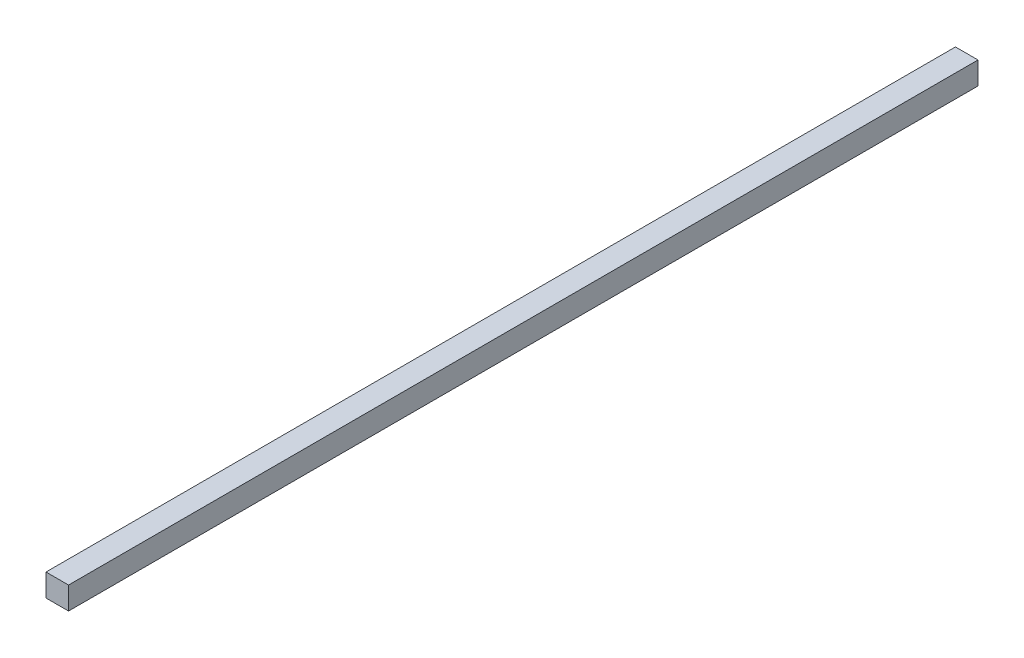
ISO-10303-21;
HEADER;
FILE_DESCRIPTION(('STEP AP214'),'2;1');
FILE_NAME('part.step','',(''),(''),'','','');
FILE_SCHEMA(('AUTOMOTIVE_DESIGN { 1 0 10303 214 1 1 1 1 }'));
ENDSEC;
DATA;
#1=APPLICATION_CONTEXT('core data for automotive mechanical design processes');
#2=APPLICATION_PROTOCOL_DEFINITION('international standard','automotive_design',2000,#1);
#3=PRODUCT_CONTEXT('',#1,'mechanical');
#4=PRODUCT('Part','Part','',(#3));
#5=PRODUCT_RELATED_PRODUCT_CATEGORY('part','',(#4));
#6=PRODUCT_DEFINITION_FORMATION('','',#4);
#7=PRODUCT_DEFINITION_CONTEXT('part definition',#1,'design');
#8=PRODUCT_DEFINITION('design','',#6,#7);
#9=PRODUCT_DEFINITION_SHAPE('','',#8);
#10=(LENGTH_UNIT() NAMED_UNIT(*) SI_UNIT(.MILLI.,.METRE.));
#11=(NAMED_UNIT(*) PLANE_ANGLE_UNIT() SI_UNIT($,.RADIAN.));
#12=(NAMED_UNIT(*) SI_UNIT($,.STERADIAN.) SOLID_ANGLE_UNIT());
#13=UNCERTAINTY_MEASURE_WITH_UNIT(LENGTH_MEASURE(1.E-05),#10,'distance_accuracy_value','');
#14=(GEOMETRIC_REPRESENTATION_CONTEXT(3) GLOBAL_UNCERTAINTY_ASSIGNED_CONTEXT((#13)) GLOBAL_UNIT_ASSIGNED_CONTEXT((#10,
#11,#12)) REPRESENTATION_CONTEXT('',''));
#15=CARTESIAN_POINT('',(0.,0.,0.));
#16=DIRECTION('',(0.,0.,1.));
#17=DIRECTION('',(1.,0.,0.));
#18=AXIS2_PLACEMENT_3D('',#15,#16,#17);
#19=CARTESIAN_POINT('',(0.,0.,512.318));
#20=DIRECTION('',(1.,0.,0.));
#21=DIRECTION('',(0.,0.,-1.));
#22=AXIS2_PLACEMENT_3D('',#19,#20,#21);
#23=PLANE('',#22);
#24=DIRECTION('',(0.,-1.,0.));
#25=VECTOR('',#24,1.);
#26=CARTESIAN_POINT('',(0.,0.,0.));
#27=LINE('',#26,#25);
#28=CARTESIAN_POINT('',(0.,12.7,0.));
#29=VERTEX_POINT('',#28);
#30=CARTESIAN_POINT('',(0.,0.,0.));
#31=VERTEX_POINT('',#30);
#32=EDGE_CURVE('E94',#29,#31,#27,.T.);
#33=ORIENTED_EDGE('',*,*,#32,.T.);
#34=DIRECTION('',(0.,0.,-1.));
#35=VECTOR('',#34,1.);
#36=CARTESIAN_POINT('',(0.,0.,512.318));
#37=LINE('',#36,#35);
#38=CARTESIAN_POINT('',(0.,0.,512.318));
#39=VERTEX_POINT('',#38);
#40=EDGE_CURVE('E11',#39,#31,#37,.T.);
#41=ORIENTED_EDGE('',*,*,#40,.F.);
#42=DIRECTION('',(0.,-1.,0.));
#43=VECTOR('',#42,1.);
#44=CARTESIAN_POINT('',(0.,0.,512.318));
#45=LINE('',#44,#43);
#46=CARTESIAN_POINT('',(0.,12.7,512.318));
#47=VERTEX_POINT('',#46);
#48=EDGE_CURVE('E82',#47,#39,#45,.T.);
#49=ORIENTED_EDGE('',*,*,#48,.F.);
#50=DIRECTION('',(0.,0.,-1.));
#51=VECTOR('',#50,1.);
#52=CARTESIAN_POINT('',(0.,12.7,512.318));
#53=LINE('',#52,#51);
#54=EDGE_CURVE('E90',#47,#29,#53,.T.);
#55=ORIENTED_EDGE('',*,*,#54,.T.);
#56=EDGE_LOOP('',(#33,#41,#49,#55));
#57=FACE_BOUND('',#56,.T.);
#58=ADVANCED_FACE('F31',(#57),#23,.F.);
#59=CARTESIAN_POINT('',(0.,0.,512.318));
#60=DIRECTION('',(0.,1.,0.));
#61=DIRECTION('',(0.,0.,1.));
#62=AXIS2_PLACEMENT_3D('',#59,#60,#61);
#63=PLANE('',#62);
#64=DIRECTION('',(1.,0.,0.));
#65=VECTOR('',#64,1.);
#66=CARTESIAN_POINT('',(0.,0.,0.));
#67=LINE('',#66,#65);
#68=CARTESIAN_POINT('',(12.7,0.,0.));
#69=VERTEX_POINT('',#68);
#70=EDGE_CURVE('E86',#31,#69,#67,.T.);
#71=ORIENTED_EDGE('',*,*,#70,.T.);
#72=DIRECTION('',(0.,0.,-1.));
#73=VECTOR('',#72,1.);
#74=CARTESIAN_POINT('',(12.7,0.,512.318));
#75=LINE('',#74,#73);
#76=CARTESIAN_POINT('',(12.7,0.,512.318));
#77=VERTEX_POINT('',#76);
#78=EDGE_CURVE('E39',#77,#69,#75,.T.);
#79=ORIENTED_EDGE('',*,*,#78,.F.);
#80=DIRECTION('',(1.,0.,0.));
#81=VECTOR('',#80,1.);
#82=CARTESIAN_POINT('',(0.,0.,512.318));
#83=LINE('',#82,#81);
#84=EDGE_CURVE('E77',#39,#77,#83,.T.);
#85=ORIENTED_EDGE('',*,*,#84,.F.);
#86=ORIENTED_EDGE('',*,*,#40,.T.);
#87=EDGE_LOOP('',(#71,#79,#85,#86));
#88=FACE_BOUND('',#87,.T.);
#89=ADVANCED_FACE('F85',(#88),#63,.F.);
#90=CARTESIAN_POINT('',(12.7,0.,512.318));
#91=DIRECTION('',(-1.,0.,0.));
#92=DIRECTION('',(0.,0.,1.));
#93=AXIS2_PLACEMENT_3D('',#90,#91,#92);
#94=PLANE('',#93);
#95=DIRECTION('',(0.,1.,0.));
#96=VECTOR('',#95,1.);
#97=CARTESIAN_POINT('',(12.7,0.,0.));
#98=LINE('',#97,#96);
#99=CARTESIAN_POINT('',(12.7,12.7,0.));
#100=VERTEX_POINT('',#99);
#101=EDGE_CURVE('E64',#69,#100,#98,.T.);
#102=ORIENTED_EDGE('',*,*,#101,.T.);
#103=DIRECTION('',(0.,0.,-1.));
#104=VECTOR('',#103,1.);
#105=CARTESIAN_POINT('',(12.7,12.7,512.318));
#106=LINE('',#105,#104);
#107=CARTESIAN_POINT('',(12.7,12.7,512.318));
#108=VERTEX_POINT('',#107);
#109=EDGE_CURVE('E87',#108,#100,#106,.T.);
#110=ORIENTED_EDGE('',*,*,#109,.F.);
#111=DIRECTION('',(0.,1.,0.));
#112=VECTOR('',#111,1.);
#113=CARTESIAN_POINT('',(12.7,0.,512.318));
#114=LINE('',#113,#112);
#115=EDGE_CURVE('E80',#77,#108,#114,.T.);
#116=ORIENTED_EDGE('',*,*,#115,.F.);
#117=ORIENTED_EDGE('',*,*,#78,.T.);
#118=EDGE_LOOP('',(#102,#110,#116,#117));
#119=FACE_BOUND('',#118,.T.);
#120=ADVANCED_FACE('F88',(#119),#94,.F.);
#121=CARTESIAN_POINT('',(0.,12.7,512.318));
#122=DIRECTION('',(0.,-1.,0.));
#123=DIRECTION('',(0.,0.,-1.));
#124=AXIS2_PLACEMENT_3D('',#121,#122,#123);
#125=PLANE('',#124);
#126=DIRECTION('',(-1.,0.,0.));
#127=VECTOR('',#126,1.);
#128=CARTESIAN_POINT('',(0.,12.7,0.));
#129=LINE('',#128,#127);
#130=EDGE_CURVE('E70',#100,#29,#129,.T.);
#131=ORIENTED_EDGE('',*,*,#130,.T.);
#132=ORIENTED_EDGE('',*,*,#54,.F.);
#133=DIRECTION('',(-1.,0.,0.));
#134=VECTOR('',#133,1.);
#135=CARTESIAN_POINT('',(0.,12.7,512.318));
#136=LINE('',#135,#134);
#137=EDGE_CURVE('E47',#108,#47,#136,.T.);
#138=ORIENTED_EDGE('',*,*,#137,.F.);
#139=ORIENTED_EDGE('',*,*,#109,.T.);
#140=EDGE_LOOP('',(#131,#132,#138,#139));
#141=FACE_BOUND('',#140,.T.);
#142=ADVANCED_FACE('F101',(#141),#125,.F.);
#143=CARTESIAN_POINT('',(0.,12.7,512.318));
#144=DIRECTION('',(0.,0.,-1.));
#145=DIRECTION('',(-1.,0.,0.));
#146=AXIS2_PLACEMENT_3D('',#143,#144,#145);
#147=PLANE('',#146);
#148=ORIENTED_EDGE('',*,*,#48,.T.);
#149=ORIENTED_EDGE('',*,*,#84,.T.);
#150=ORIENTED_EDGE('',*,*,#115,.T.);
#151=ORIENTED_EDGE('',*,*,#137,.T.);
#152=EDGE_LOOP('',(#148,#149,#150,#151));
#153=FACE_BOUND('',#152,.T.);
#154=ADVANCED_FACE('F78',(#153),#147,.F.);
#155=CARTESIAN_POINT('',(0.,12.7,0.));
#156=DIRECTION('',(0.,0.,-1.));
#157=DIRECTION('',(-1.,0.,0.));
#158=AXIS2_PLACEMENT_3D('',#155,#156,#157);
#159=PLANE('',#158);
#160=ORIENTED_EDGE('',*,*,#32,.F.);
#161=ORIENTED_EDGE('',*,*,#130,.F.);
#162=ORIENTED_EDGE('',*,*,#101,.F.);
#163=ORIENTED_EDGE('',*,*,#70,.F.);
#164=EDGE_LOOP('',(#160,#161,#162,#163));
#165=FACE_BOUND('',#164,.T.);
#166=ADVANCED_FACE('F104',(#165),#159,.T.);
#167=CLOSED_SHELL('',(#58,#89,#120,#142,#154,#166));
#168=MANIFOLD_SOLID_BREP('B2',#167);
#169=ADVANCED_BREP_SHAPE_REPRESENTATION('',(#18,#168),#14);
#170=SHAPE_DEFINITION_REPRESENTATION(#9,#169);
ENDSEC;
END-ISO-10303-21;
